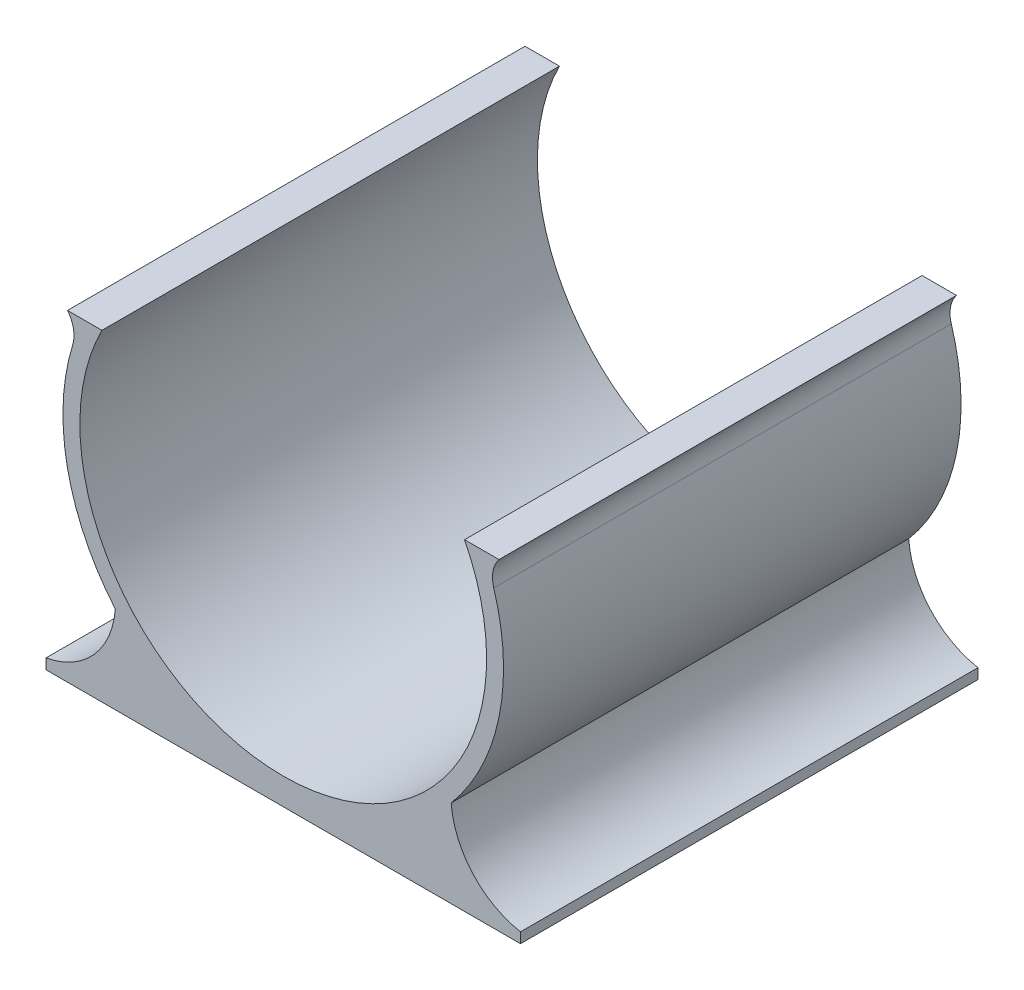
from build123d import *

# Parameters (mm, degrees)
SKETCH1_W          = 28
SKETCH1_H          = 27
EXTRUDE1_DEPTH     = 19
CUT_EXTRUDE1_REACH = 35.912
SKETCH2_R          = 12


with BuildPart() as part:
    # Sketch1 → Extrude1 (new body)
    with BuildSketch(Plane.XZ.offset(14)):
        with Locations((1, 13.5)):
            Rectangle(SKETCH1_W, SKETCH1_H)
    extrude(amount=-EXTRUDE1_DEPTH)

    # Sketch2 → Cut-Extrude1 (cut, up to next)
    with BuildSketch(Plane(origin=(0, 0, 0), x_dir=(-1, 0, 0), z_dir=(0, 0, -1)), mode=Mode.PRIVATE) as cut_extrude1_sk1:
        with Locations((-1, -0.433588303)):
            Circle(SKETCH2_R)
    cut_extrude1_tool1 = extrude(cut_extrude1_sk1.sketch, amount=-CUT_EXTRUDE1_REACH, mode=Mode.PRIVATE) & part.part
    # Sketch2 → Cut-Extrude1 (cut, up to next)
    with BuildSketch(Plane(origin=(0, 0, 0), x_dir=(-1, 0, 0), z_dir=(0, 0, -1)), mode=Mode.PRIVATE) as cut_extrude1_sk2:
        with BuildLine():
            Line((-14.599430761, 5.577635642), (-15.895718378, 5.577635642))
            Line((-15.895718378, 5.577635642), (-15.895718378, -13.47264249))
            ThreePointArc((-15.895718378, -13.47264249), (-12.495341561, -12.13835354), (-10.909798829, -8.84761749))
            ThreePointArc((-10.909798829, -8.84761749), (-13.734270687, -3.048612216), (-13.423692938, 3.394185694))
            ThreePointArc((-13.423692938, 3.394185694), (-13.554596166, 4.73197623), (-14.599430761, 5.577635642))
        make_face()
    cut_extrude1_tool2 = extrude(cut_extrude1_sk2.sketch, amount=-CUT_EXTRUDE1_REACH, mode=Mode.PRIVATE) & part.part
    # Sketch2 → Cut-Extrude1 (cut, up to next)
    with BuildSketch(Plane(origin=(0, 0, 0), x_dir=(-1, 0, 0), z_dir=(0, 0, -1)), mode=Mode.PRIVATE) as cut_extrude1_sk3:
        with BuildLine():
            Line((12.599430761, 5.577635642), (13.895718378, 5.577635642))
            Line((13.895718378, 5.577635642), (13.895718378, -13.47264249))
            ThreePointArc((13.895718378, -13.47264249), (10.495341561, -12.13835354), (8.909798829, -8.84761749))
            ThreePointArc((8.909798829, -8.84761749), (11.734270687, -3.048612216), (11.423692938, 3.394185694))
            ThreePointArc((11.423692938, 3.394185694), (11.554596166, 4.73197623), (12.599430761, 5.577635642))
        make_face()
    cut_extrude1_tool3 = extrude(cut_extrude1_sk3.sketch, amount=-CUT_EXTRUDE1_REACH, mode=Mode.PRIVATE) & part.part
    add(cut_extrude1_tool1.solids().sort_by_distance((1, -0.433588, 0))[0], mode=Mode.SUBTRACT)
    add(cut_extrude1_tool2.solids().sort_by_distance((14.269063, -5.227779, 0))[0], mode=Mode.SUBTRACT)
    add(cut_extrude1_tool3.solids().sort_by_distance((-12.269063, -5.227779, 0))[0], mode=Mode.SUBTRACT)


solid = part.part
